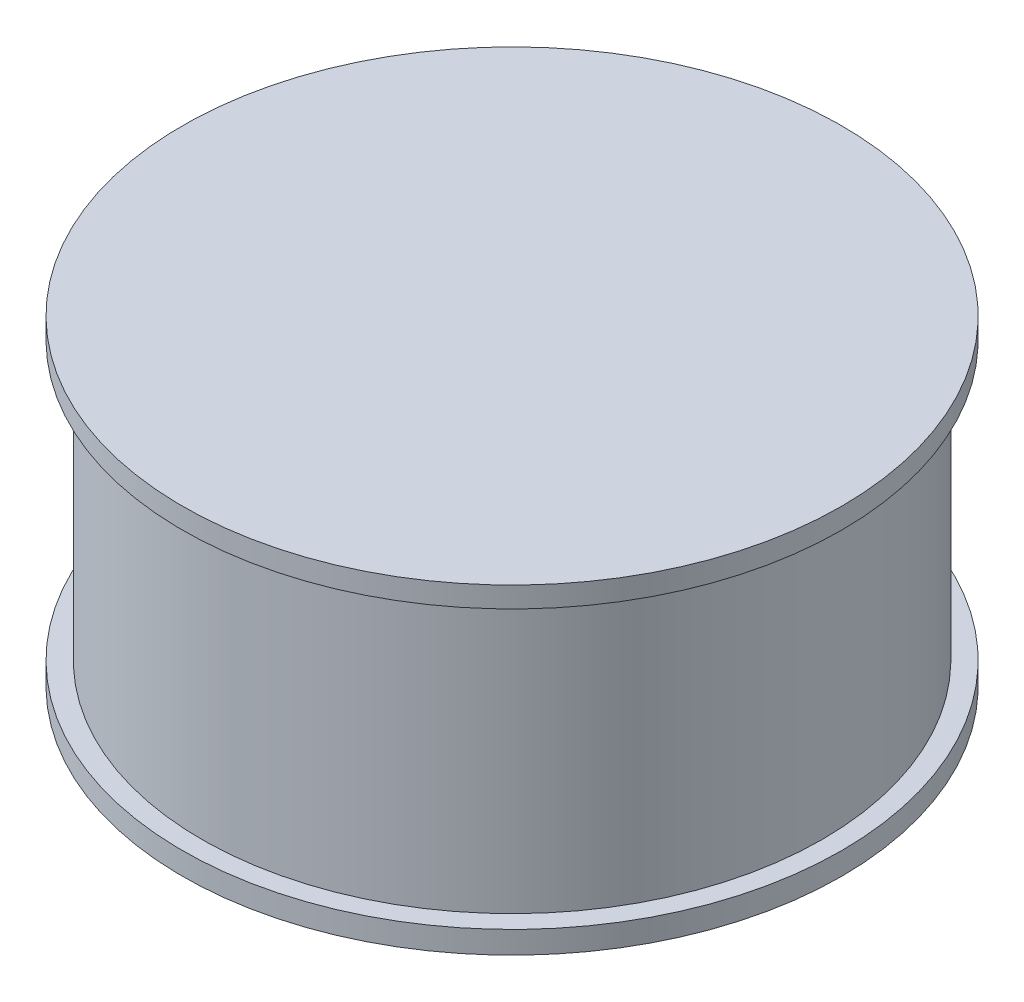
ISO-10303-21;
HEADER;
FILE_DESCRIPTION(('STEP AP214'),'2;1');
FILE_NAME('part.step','',(''),(''),'','','');
FILE_SCHEMA(('AUTOMOTIVE_DESIGN { 1 0 10303 214 1 1 1 1 }'));
ENDSEC;
DATA;
#1=APPLICATION_CONTEXT('core data for automotive mechanical design processes');
#2=APPLICATION_PROTOCOL_DEFINITION('international standard','automotive_design',2000,#1);
#3=PRODUCT_CONTEXT('',#1,'mechanical');
#4=PRODUCT('Part','Part','',(#3));
#5=PRODUCT_RELATED_PRODUCT_CATEGORY('part','',(#4));
#6=PRODUCT_DEFINITION_FORMATION('','',#4);
#7=PRODUCT_DEFINITION_CONTEXT('part definition',#1,'design');
#8=PRODUCT_DEFINITION('design','',#6,#7);
#9=PRODUCT_DEFINITION_SHAPE('','',#8);
#10=(LENGTH_UNIT() NAMED_UNIT(*) SI_UNIT(.MILLI.,.METRE.));
#11=(NAMED_UNIT(*) PLANE_ANGLE_UNIT() SI_UNIT($,.RADIAN.));
#12=(NAMED_UNIT(*) SI_UNIT($,.STERADIAN.) SOLID_ANGLE_UNIT());
#13=UNCERTAINTY_MEASURE_WITH_UNIT(LENGTH_MEASURE(1.E-05),#10,'distance_accuracy_value','');
#14=(GEOMETRIC_REPRESENTATION_CONTEXT(3) GLOBAL_UNCERTAINTY_ASSIGNED_CONTEXT((#13)) GLOBAL_UNIT_ASSIGNED_CONTEXT((#10,
#11,#12)) REPRESENTATION_CONTEXT('',''));
#15=CARTESIAN_POINT('',(0.,0.,0.));
#16=DIRECTION('',(0.,0.,1.));
#17=DIRECTION('',(1.,0.,0.));
#18=AXIS2_PLACEMENT_3D('',#15,#16,#17);
#19=CARTESIAN_POINT('',(0.,59.0694125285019,0.));
#20=DIRECTION('',(0.,-1.,0.));
#21=DIRECTION('',(1.,0.,0.));
#22=AXIS2_PLACEMENT_3D('',#19,#20,#21);
#23=CYLINDRICAL_SURFACE('',#22,8.00000000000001);
#24=CARTESIAN_POINT('',(0.,85.9185594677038,0.));
#25=DIRECTION('',(0.,-1.,0.));
#26=DIRECTION('',(1.,0.,0.));
#27=AXIS2_PLACEMENT_3D('',#24,#25,#26);
#28=CIRCLE('',#27,8.00000000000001);
#29=CARTESIAN_POINT('',(8.00000000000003,85.9185594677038,0.));
#30=VERTEX_POINT('',#29);
#31=EDGE_CURVE('E10',#30,#30,#28,.T.);
#32=ORIENTED_EDGE('',*,*,#31,.F.);
#33=EDGE_LOOP('',(#32));
#34=FACE_BOUND('',#33,.T.);
#35=CARTESIAN_POINT('',(0.,58.0194458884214,0.));
#36=DIRECTION('',(0.,-1.,0.));
#37=DIRECTION('',(1.,0.,0.));
#38=AXIS2_PLACEMENT_3D('',#35,#36,#37);
#39=CIRCLE('',#38,8.00000000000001);
#40=CARTESIAN_POINT('',(8.00000000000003,58.0194458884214,0.));
#41=VERTEX_POINT('',#40);
#42=EDGE_CURVE('E58',#41,#41,#39,.T.);
#43=ORIENTED_EDGE('',*,*,#42,.T.);
#44=EDGE_LOOP('',(#43));
#45=FACE_BOUND('',#44,.T.);
#46=ADVANCED_FACE('F30',(#34,#45),#23,.F.);
#47=CARTESIAN_POINT('',(0.,85.9185594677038,0.));
#48=DIRECTION('',(0.,1.,0.));
#49=DIRECTION('',(-1.,0.,0.));
#50=AXIS2_PLACEMENT_3D('',#47,#48,#49);
#51=PLANE('',#50);
#52=ORIENTED_EDGE('',*,*,#31,.T.);
#53=EDGE_LOOP('',(#52));
#54=FACE_BOUND('',#53,.T.);
#55=ADVANCED_FACE('F100',(#54),#51,.F.);
#56=CARTESIAN_POINT('',(-34.6999065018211,91.7695653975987,0.));
#57=DIRECTION('',(0.,-1.,0.));
#58=DIRECTION('',(1.,0.,0.));
#59=AXIS2_PLACEMENT_3D('',#56,#57,#58);
#60=PLANE('',#59);
#61=CARTESIAN_POINT('',(0.,91.7695653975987,0.));
#62=DIRECTION('',(0.,-1.,0.));
#63=DIRECTION('',(1.,0.,0.));
#64=AXIS2_PLACEMENT_3D('',#61,#62,#63);
#65=CIRCLE('',#64,34.6999065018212);
#66=CARTESIAN_POINT('',(34.6999065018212,91.7695653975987,0.));
#67=VERTEX_POINT('',#66);
#68=EDGE_CURVE('E36',#67,#67,#65,.T.);
#69=ORIENTED_EDGE('',*,*,#68,.F.);
#70=EDGE_LOOP('',(#69));
#71=FACE_BOUND('',#70,.T.);
#72=ADVANCED_FACE('F95',(#71),#60,.F.);
#73=CARTESIAN_POINT('',(0.,59.0694125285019,0.));
#74=DIRECTION('',(0.,-1.,0.));
#75=DIRECTION('',(1.,0.,0.));
#76=AXIS2_PLACEMENT_3D('',#73,#74,#75);
#77=CYLINDRICAL_SURFACE('',#76,34.6999065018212);
#78=CARTESIAN_POINT('',(0.,89.5889239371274,0.));
#79=DIRECTION('',(0.,-1.,0.));
#80=DIRECTION('',(1.,0.,0.));
#81=AXIS2_PLACEMENT_3D('',#78,#79,#80);
#82=CIRCLE('',#81,34.6999065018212);
#83=CARTESIAN_POINT('',(34.6999065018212,89.5889239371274,0.));
#84=VERTEX_POINT('',#83);
#85=EDGE_CURVE('E40',#84,#84,#82,.T.);
#86=ORIENTED_EDGE('',*,*,#85,.F.);
#87=EDGE_LOOP('',(#86));
#88=FACE_BOUND('',#87,.T.);
#89=ORIENTED_EDGE('',*,*,#68,.T.);
#90=EDGE_LOOP('',(#89));
#91=FACE_BOUND('',#90,.T.);
#92=ADVANCED_FACE('F90',(#88,#91),#77,.T.);
#93=CARTESIAN_POINT('',(-34.6999065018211,89.5889239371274,0.));
#94=DIRECTION('',(0.,1.,0.));
#95=DIRECTION('',(-1.,0.,0.));
#96=AXIS2_PLACEMENT_3D('',#93,#94,#95);
#97=PLANE('',#96);
#98=CARTESIAN_POINT('',(0.,89.5889239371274,0.));
#99=DIRECTION('',(0.,-1.,0.));
#100=DIRECTION('',(1.,0.,0.));
#101=AXIS2_PLACEMENT_3D('',#98,#99,#100);
#102=CIRCLE('',#101,32.6646411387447);
#103=CARTESIAN_POINT('',(32.6646411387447,89.5889239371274,0.));
#104=VERTEX_POINT('',#103);
#105=EDGE_CURVE('E44',#104,#104,#102,.T.);
#106=ORIENTED_EDGE('',*,*,#105,.F.);
#107=EDGE_LOOP('',(#106));
#108=FACE_BOUND('',#107,.T.);
#109=ORIENTED_EDGE('',*,*,#85,.T.);
#110=EDGE_LOOP('',(#109));
#111=FACE_BOUND('',#110,.T.);
#112=ADVANCED_FACE('F84',(#108,#111),#97,.F.);
#113=CARTESIAN_POINT('',(0.,59.0694125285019,0.));
#114=DIRECTION('',(0.,-1.,0.));
#115=DIRECTION('',(1.,0.,0.));
#116=AXIS2_PLACEMENT_3D('',#113,#114,#115);
#117=CYLINDRICAL_SURFACE('',#116,32.6646411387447);
#118=CARTESIAN_POINT('',(0.,60.368328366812,0.));
#119=DIRECTION('',(0.,-1.,0.));
#120=DIRECTION('',(1.,0.,0.));
#121=AXIS2_PLACEMENT_3D('',#118,#119,#120);
#122=CIRCLE('',#121,32.6646411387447);
#123=CARTESIAN_POINT('',(32.6646411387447,60.368328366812,0.));
#124=VERTEX_POINT('',#123);
#125=EDGE_CURVE('E49',#124,#124,#122,.T.);
#126=ORIENTED_EDGE('',*,*,#125,.F.);
#127=EDGE_LOOP('',(#126));
#128=FACE_BOUND('',#127,.T.);
#129=ORIENTED_EDGE('',*,*,#105,.T.);
#130=EDGE_LOOP('',(#129));
#131=FACE_BOUND('',#130,.T.);
#132=ADVANCED_FACE('F78',(#128,#131),#117,.T.);
#133=CARTESIAN_POINT('',(-32.6646411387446,60.368328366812,0.));
#134=DIRECTION('',(0.,-1.,0.));
#135=DIRECTION('',(1.,0.,0.));
#136=AXIS2_PLACEMENT_3D('',#133,#134,#135);
#137=PLANE('',#136);
#138=CARTESIAN_POINT('',(0.,60.368328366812,0.));
#139=DIRECTION('',(0.,-1.,0.));
#140=DIRECTION('',(1.,0.,0.));
#141=AXIS2_PLACEMENT_3D('',#138,#139,#140);
#142=CIRCLE('',#141,34.6999065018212);
#143=CARTESIAN_POINT('',(34.6999065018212,60.368328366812,0.));
#144=VERTEX_POINT('',#143);
#145=EDGE_CURVE('E52',#144,#144,#142,.T.);
#146=ORIENTED_EDGE('',*,*,#145,.F.);
#147=EDGE_LOOP('',(#146));
#148=FACE_BOUND('',#147,.T.);
#149=ORIENTED_EDGE('',*,*,#125,.T.);
#150=EDGE_LOOP('',(#149));
#151=FACE_BOUND('',#150,.T.);
#152=ADVANCED_FACE('F72',(#148,#151),#137,.F.);
#153=CARTESIAN_POINT('',(0.,59.0694125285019,0.));
#154=DIRECTION('',(0.,-1.,0.));
#155=DIRECTION('',(1.,0.,0.));
#156=AXIS2_PLACEMENT_3D('',#153,#154,#155);
#157=CYLINDRICAL_SURFACE('',#156,34.6999065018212);
#158=CARTESIAN_POINT('',(0.,58.0194458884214,0.));
#159=DIRECTION('',(0.,-1.,0.));
#160=DIRECTION('',(1.,0.,0.));
#161=AXIS2_PLACEMENT_3D('',#158,#159,#160);
#162=CIRCLE('',#161,34.6999065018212);
#163=CARTESIAN_POINT('',(34.6999065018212,58.0194458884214,0.));
#164=VERTEX_POINT('',#163);
#165=EDGE_CURVE('E55',#164,#164,#162,.T.);
#166=ORIENTED_EDGE('',*,*,#165,.F.);
#167=EDGE_LOOP('',(#166));
#168=FACE_BOUND('',#167,.T.);
#169=ORIENTED_EDGE('',*,*,#145,.T.);
#170=EDGE_LOOP('',(#169));
#171=FACE_BOUND('',#170,.T.);
#172=ADVANCED_FACE('F66',(#168,#171),#157,.T.);
#173=CARTESIAN_POINT('',(-7.99999999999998,58.0194458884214,0.));
#174=DIRECTION('',(0.,1.,0.));
#175=DIRECTION('',(-1.,0.,0.));
#176=AXIS2_PLACEMENT_3D('',#173,#174,#175);
#177=PLANE('',#176);
#178=ORIENTED_EDGE('',*,*,#42,.F.);
#179=EDGE_LOOP('',(#178));
#180=FACE_BOUND('',#179,.T.);
#181=ORIENTED_EDGE('',*,*,#165,.T.);
#182=EDGE_LOOP('',(#181));
#183=FACE_BOUND('',#182,.T.);
#184=ADVANCED_FACE('F63',(#180,#183),#177,.F.);
#185=CLOSED_SHELL('',(#46,#55,#72,#92,#112,#132,#152,#172,#184));
#186=MANIFOLD_SOLID_BREP('B2',#185);
#187=ADVANCED_BREP_SHAPE_REPRESENTATION('',(#18,#186),#14);
#188=SHAPE_DEFINITION_REPRESENTATION(#9,#187);
ENDSEC;
END-ISO-10303-21;
